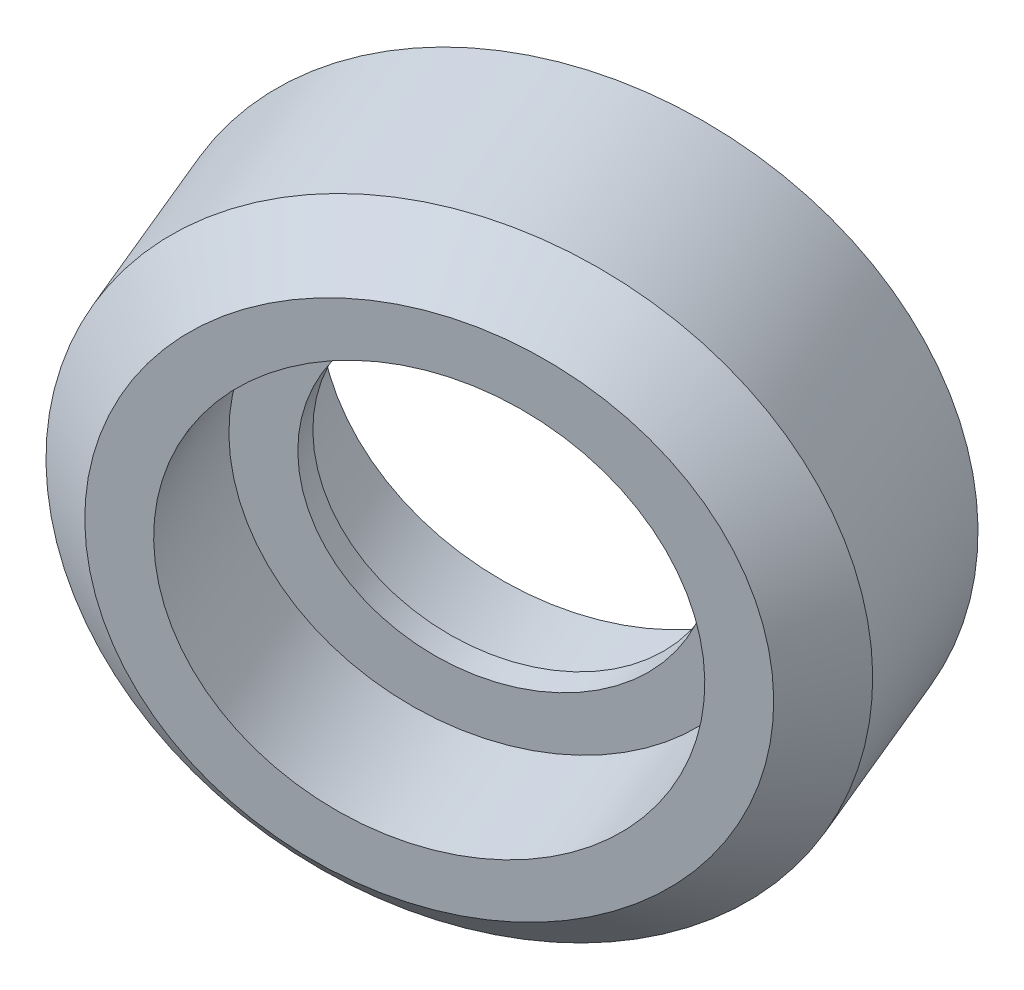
ISO-10303-21;
HEADER;
FILE_DESCRIPTION(('STEP AP214'),'2;1');
FILE_NAME('part.step','',(''),(''),'','','');
FILE_SCHEMA(('AUTOMOTIVE_DESIGN { 1 0 10303 214 1 1 1 1 }'));
ENDSEC;
DATA;
#1=APPLICATION_CONTEXT('core data for automotive mechanical design processes');
#2=APPLICATION_PROTOCOL_DEFINITION('international standard','automotive_design',2000,#1);
#3=PRODUCT_CONTEXT('',#1,'mechanical');
#4=PRODUCT('Part','Part','',(#3));
#5=PRODUCT_RELATED_PRODUCT_CATEGORY('part','',(#4));
#6=PRODUCT_DEFINITION_FORMATION('','',#4);
#7=PRODUCT_DEFINITION_CONTEXT('part definition',#1,'design');
#8=PRODUCT_DEFINITION('design','',#6,#7);
#9=PRODUCT_DEFINITION_SHAPE('','',#8);
#10=(LENGTH_UNIT() NAMED_UNIT(*) SI_UNIT(.MILLI.,.METRE.));
#11=(NAMED_UNIT(*) PLANE_ANGLE_UNIT() SI_UNIT($,.RADIAN.));
#12=(NAMED_UNIT(*) SI_UNIT($,.STERADIAN.) SOLID_ANGLE_UNIT());
#13=UNCERTAINTY_MEASURE_WITH_UNIT(LENGTH_MEASURE(1.E-05),#10,'distance_accuracy_value','');
#14=(GEOMETRIC_REPRESENTATION_CONTEXT(3) GLOBAL_UNCERTAINTY_ASSIGNED_CONTEXT((#13)) GLOBAL_UNIT_ASSIGNED_CONTEXT((#10,
#11,#12)) REPRESENTATION_CONTEXT('',''));
#15=CARTESIAN_POINT('',(0.,0.,0.));
#16=DIRECTION('',(0.,0.,1.));
#17=DIRECTION('',(1.,0.,0.));
#18=AXIS2_PLACEMENT_3D('',#15,#16,#17);
#19=CARTESIAN_POINT('',(31.8150018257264,0.726086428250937,-23.3302898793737));
#20=DIRECTION('',(-0.364454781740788,0.0340887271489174,-0.93059694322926));
#21=DIRECTION('',(-0.931138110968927,0.,0.364666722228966));
#22=AXIS2_PLACEMENT_3D('',#19,#20,#21);
#23=CYLINDRICAL_SURFACE('',#22,6.);
#24=CARTESIAN_POINT('',(34.0017305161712,0.521554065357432,-17.7467082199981));
#25=DIRECTION('',(-0.364454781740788,0.0340887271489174,-0.93059694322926));
#26=DIRECTION('',(-0.931138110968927,0.,0.364666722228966));
#27=AXIS2_PLACEMENT_3D('',#24,#25,#26);
#28=CIRCLE('',#27,6.);
#29=CARTESIAN_POINT('',(28.4149018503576,0.521554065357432,-15.5587078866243));
#30=VERTEX_POINT('',#29);
#31=EDGE_CURVE('E18',#30,#30,#28,.T.);
#32=ORIENTED_EDGE('',*,*,#31,.F.);
#33=EDGE_LOOP('',(#32));
#34=FACE_BOUND('',#33,.T.);
#35=CARTESIAN_POINT('',(33.6372757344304,0.555642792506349,-18.6773051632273));
#36=DIRECTION('',(-0.364454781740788,0.0340887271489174,-0.93059694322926));
#37=DIRECTION('',(-0.931138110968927,0.,0.364666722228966));
#38=AXIS2_PLACEMENT_3D('',#35,#36,#37);
#39=CIRCLE('',#38,6.);
#40=CARTESIAN_POINT('',(28.0504470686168,0.555642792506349,-16.4893048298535));
#41=VERTEX_POINT('',#40);
#42=EDGE_CURVE('E46',#41,#41,#39,.T.);
#43=ORIENTED_EDGE('',*,*,#42,.T.);
#44=EDGE_LOOP('',(#43));
#45=FACE_BOUND('',#44,.T.);
#46=ADVANCED_FACE('F15',(#34,#45),#23,.F.);
#47=CARTESIAN_POINT('',(34.0017305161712,0.521554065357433,-17.7467082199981));
#48=DIRECTION('',(0.364454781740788,-0.0340887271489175,0.93059694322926));
#49=DIRECTION('',(0.931138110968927,0.,-0.364666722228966));
#50=AXIS2_PLACEMENT_3D('',#47,#48,#49);
#51=PLANE('',#50);
#52=ORIENTED_EDGE('',*,*,#31,.T.);
#53=EDGE_LOOP('',(#52));
#54=FACE_BOUND('',#53,.T.);
#55=CARTESIAN_POINT('',(34.0017305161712,0.52155406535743,-17.7467082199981));
#56=DIRECTION('',(-0.364454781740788,0.0340887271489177,-0.930596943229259));
#57=DIRECTION('',(-0.931138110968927,0.,0.364666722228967));
#58=AXIS2_PLACEMENT_3D('',#55,#56,#57);
#59=CIRCLE('',#58,8.00000000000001);
#60=CARTESIAN_POINT('',(26.5526256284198,0.52155406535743,-14.8293744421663));
#61=VERTEX_POINT('',#60);
#62=EDGE_CURVE('E44',#61,#61,#59,.F.);
#63=ORIENTED_EDGE('',*,*,#62,.T.);
#64=EDGE_LOOP('',(#63));
#65=FACE_BOUND('',#64,.T.);
#66=ADVANCED_FACE('F53',(#54,#65),#51,.T.);
#67=CARTESIAN_POINT('',(33.6372757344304,0.55564279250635,-18.6773051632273));
#68=DIRECTION('',(0.364454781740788,-0.0340887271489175,0.93059694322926));
#69=DIRECTION('',(0.931138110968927,0.,-0.364666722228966));
#70=AXIS2_PLACEMENT_3D('',#67,#68,#69);
#71=PLANE('',#70);
#72=ORIENTED_EDGE('',*,*,#42,.F.);
#73=EDGE_LOOP('',(#72));
#74=FACE_BOUND('',#73,.T.);
#75=CARTESIAN_POINT('',(33.6372757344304,0.555642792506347,-18.6773051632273));
#76=DIRECTION('',(-0.364454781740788,0.0340887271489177,-0.930596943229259));
#77=DIRECTION('',(-0.931138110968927,0.,0.364666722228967));
#78=AXIS2_PLACEMENT_3D('',#75,#76,#77);
#79=CIRCLE('',#78,8.00000000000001);
#80=CARTESIAN_POINT('',(26.188170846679,0.555642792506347,-15.7599713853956));
#81=VERTEX_POINT('',#80);
#82=EDGE_CURVE('E41',#81,#81,#79,.T.);
#83=ORIENTED_EDGE('',*,*,#82,.T.);
#84=EDGE_LOOP('',(#83));
#85=FACE_BOUND('',#84,.T.);
#86=ADVANCED_FACE('F61',(#74,#85),#71,.F.);
#87=CARTESIAN_POINT('',(31.8150018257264,0.726086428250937,-23.3302898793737));
#88=DIRECTION('',(-0.364454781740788,0.0340887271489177,-0.930596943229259));
#89=DIRECTION('',(-0.931138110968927,0.,0.364666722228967));
#90=AXIS2_PLACEMENT_3D('',#87,#88,#89);
#91=CYLINDRICAL_SURFACE('',#90,8.00000000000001);
#92=CARTESIAN_POINT('',(35.8240044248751,0.351110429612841,-13.0937235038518));
#93=DIRECTION('',(-0.364454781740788,0.0340887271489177,-0.930596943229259));
#94=DIRECTION('',(-0.931138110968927,0.,0.364666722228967));
#95=AXIS2_PLACEMENT_3D('',#92,#93,#94);
#96=CIRCLE('',#95,8.00000000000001);
#97=CARTESIAN_POINT('',(28.3748995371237,0.351110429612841,-10.17638972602));
#98=VERTEX_POINT('',#97);
#99=EDGE_CURVE('E38',#98,#98,#96,.F.);
#100=ORIENTED_EDGE('',*,*,#99,.T.);
#101=EDGE_LOOP('',(#100));
#102=FACE_BOUND('',#101,.T.);
#103=ORIENTED_EDGE('',*,*,#62,.F.);
#104=EDGE_LOOP('',(#103));
#105=FACE_BOUND('',#104,.T.);
#106=ADVANCED_FACE('F88',(#102,#105),#91,.F.);
#107=CARTESIAN_POINT('',(31.8150018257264,0.726086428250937,-23.3302898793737));
#108=DIRECTION('',(-0.364454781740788,0.0340887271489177,-0.930596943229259));
#109=DIRECTION('',(-0.931138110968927,0.,0.364666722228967));
#110=AXIS2_PLACEMENT_3D('',#107,#108,#109);
#111=CYLINDRICAL_SURFACE('',#110,8.00000000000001);
#112=CARTESIAN_POINT('',(31.8150018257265,0.726086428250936,-23.3302898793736));
#113=DIRECTION('',(-0.364454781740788,0.0340887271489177,-0.930596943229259));
#114=DIRECTION('',(-0.931138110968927,0.,0.364666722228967));
#115=AXIS2_PLACEMENT_3D('',#112,#113,#114);
#116=CIRCLE('',#115,8.00000000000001);
#117=CARTESIAN_POINT('',(24.365896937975,0.726086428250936,-20.4129561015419));
#118=VERTEX_POINT('',#117);
#119=EDGE_CURVE('E35',#118,#118,#116,.F.);
#120=ORIENTED_EDGE('',*,*,#119,.F.);
#121=EDGE_LOOP('',(#120));
#122=FACE_BOUND('',#121,.T.);
#123=ORIENTED_EDGE('',*,*,#82,.F.);
#124=EDGE_LOOP('',(#123));
#125=FACE_BOUND('',#124,.T.);
#126=ADVANCED_FACE('F84',(#122,#125),#111,.F.);
#127=CARTESIAN_POINT('',(35.8240044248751,0.351110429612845,-13.0937235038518));
#128=DIRECTION('',(-0.364454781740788,0.0340887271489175,-0.930596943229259));
#129=DIRECTION('',(-0.931138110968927,0.,0.364666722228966));
#130=AXIS2_PLACEMENT_3D('',#127,#128,#129);
#131=PLANE('',#130);
#132=ORIENTED_EDGE('',*,*,#99,.F.);
#133=EDGE_LOOP('',(#132));
#134=FACE_BOUND('',#133,.T.);
#135=CARTESIAN_POINT('',(35.8240044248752,0.351110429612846,-13.0937235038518));
#136=DIRECTION('',(-0.364454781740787,0.0340887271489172,-0.93059694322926));
#137=DIRECTION('',(-0.931138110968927,0.,0.364666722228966));
#138=AXIS2_PLACEMENT_3D('',#135,#136,#137);
#139=CIRCLE('',#138,9.99999999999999);
#140=CARTESIAN_POINT('',(26.5126233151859,0.351110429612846,-9.44705628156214));
#141=VERTEX_POINT('',#140);
#142=EDGE_CURVE('E32',#141,#141,#139,.T.);
#143=ORIENTED_EDGE('',*,*,#142,.F.);
#144=EDGE_LOOP('',(#143));
#145=FACE_BOUND('',#144,.T.);
#146=ADVANCED_FACE('F80',(#134,#145),#131,.F.);
#147=CARTESIAN_POINT('',(31.8150018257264,0.726086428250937,-23.3302898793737));
#148=DIRECTION('',(-0.364454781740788,0.0340887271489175,-0.930596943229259));
#149=DIRECTION('',(-0.931138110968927,0.,0.364666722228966));
#150=AXIS2_PLACEMENT_3D('',#147,#148,#149);
#151=PLANE('',#150);
#152=ORIENTED_EDGE('',*,*,#119,.T.);
#153=EDGE_LOOP('',(#152));
#154=FACE_BOUND('',#153,.T.);
#155=CARTESIAN_POINT('',(31.8150018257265,0.726086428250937,-23.3302898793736));
#156=DIRECTION('',(0.364454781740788,-0.0340887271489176,0.930596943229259));
#157=DIRECTION('',(0.931138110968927,0.,-0.364666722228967));
#158=AXIS2_PLACEMENT_3D('',#155,#156,#157);
#159=CIRCLE('',#158,10.);
#160=CARTESIAN_POINT('',(41.1263829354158,0.726086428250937,-26.9769571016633));
#161=VERTEX_POINT('',#160);
#162=EDGE_CURVE('E27',#161,#161,#159,.T.);
#163=ORIENTED_EDGE('',*,*,#162,.F.);
#164=EDGE_LOOP('',(#163));
#165=FACE_BOUND('',#164,.T.);
#166=ADVANCED_FACE('F76',(#154,#165),#151,.T.);
#167=CARTESIAN_POINT('',(35.0950948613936,0.419287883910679,-14.9549173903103));
#168=DIRECTION('',(-0.364454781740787,0.0340887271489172,-0.93059694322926));
#169=DIRECTION('',(-0.931138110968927,0.,0.364666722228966));
#170=AXIS2_PLACEMENT_3D('',#167,#168,#169);
#171=CONICAL_SURFACE('',#170,12.,0.785398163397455);
#172=CARTESIAN_POINT('',(35.0950948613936,0.419287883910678,-14.9549173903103));
#173=DIRECTION('',(-0.364454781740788,0.0340887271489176,-0.93059694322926));
#174=DIRECTION('',(-0.931138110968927,0.,0.364666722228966));
#175=AXIS2_PLACEMENT_3D('',#172,#173,#174);
#176=CIRCLE('',#175,12.);
#177=CARTESIAN_POINT('',(23.9214375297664,0.419287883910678,-10.5789167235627));
#178=VERTEX_POINT('',#177);
#179=EDGE_CURVE('E22',#178,#178,#176,.T.);
#180=ORIENTED_EDGE('',*,*,#179,.F.);
#181=EDGE_LOOP('',(#180));
#182=FACE_BOUND('',#181,.T.);
#183=ORIENTED_EDGE('',*,*,#142,.T.);
#184=EDGE_LOOP('',(#183));
#185=FACE_BOUND('',#184,.T.);
#186=ADVANCED_FACE('F69',(#182,#185),#171,.T.);
#187=CARTESIAN_POINT('',(32.543911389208,0.657908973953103,-21.4690959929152));
#188=DIRECTION('',(0.364454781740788,-0.0340887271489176,0.930596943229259));
#189=DIRECTION('',(0.931138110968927,0.,-0.364666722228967));
#190=AXIS2_PLACEMENT_3D('',#187,#188,#189);
#191=CONICAL_SURFACE('',#190,12.,0.785398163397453);
#192=CARTESIAN_POINT('',(32.543911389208,0.657908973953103,-21.4690959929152));
#193=DIRECTION('',(-0.364454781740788,0.0340887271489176,-0.93059694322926));
#194=DIRECTION('',(-0.931138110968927,0.,0.364666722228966));
#195=AXIS2_PLACEMENT_3D('',#192,#193,#194);
#196=CIRCLE('',#195,12.);
#197=CARTESIAN_POINT('',(21.3702540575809,0.657908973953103,-17.0930953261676));
#198=VERTEX_POINT('',#197);
#199=EDGE_CURVE('E10',#198,#198,#196,.F.);
#200=ORIENTED_EDGE('',*,*,#199,.F.);
#201=EDGE_LOOP('',(#200));
#202=FACE_BOUND('',#201,.T.);
#203=ORIENTED_EDGE('',*,*,#162,.T.);
#204=EDGE_LOOP('',(#203));
#205=FACE_BOUND('',#204,.T.);
#206=ADVANCED_FACE('F64',(#202,#205),#191,.T.);
#207=CARTESIAN_POINT('',(31.8150018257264,0.726086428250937,-23.3302898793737));
#208=DIRECTION('',(-0.364454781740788,0.0340887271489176,-0.93059694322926));
#209=DIRECTION('',(-0.931138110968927,0.,0.364666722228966));
#210=AXIS2_PLACEMENT_3D('',#207,#208,#209);
#211=CYLINDRICAL_SURFACE('',#210,12.);
#212=ORIENTED_EDGE('',*,*,#199,.T.);
#213=EDGE_LOOP('',(#212));
#214=FACE_BOUND('',#213,.T.);
#215=ORIENTED_EDGE('',*,*,#179,.T.);
#216=EDGE_LOOP('',(#215));
#217=FACE_BOUND('',#216,.T.);
#218=ADVANCED_FACE('F62',(#214,#217),#211,.T.);
#219=CLOSED_SHELL('',(#46,#66,#86,#106,#126,#146,#166,#186,#206,#218));
#220=MANIFOLD_SOLID_BREP('B1',#219);
#221=ADVANCED_BREP_SHAPE_REPRESENTATION('',(#18,#220),#14);
#222=SHAPE_DEFINITION_REPRESENTATION(#9,#221);
ENDSEC;
END-ISO-10303-21;
